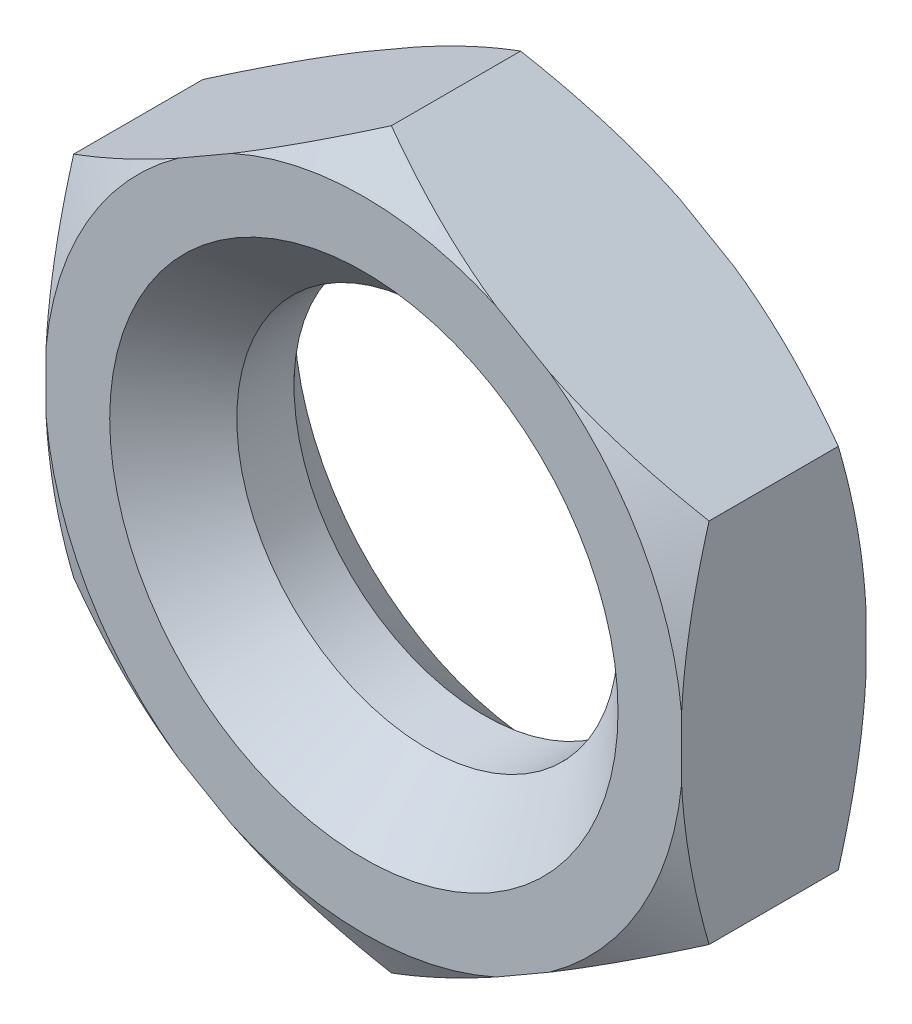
from build123d import *

# Parameters (mm, degrees)
BOSS_EXTRUDE1_DEPTH = 1.45
SKETCH6_R           = 3
CUT_EXTRUDE1_DEPTH  = 2.9
CHAMFER1_SIZE       = 1


with BuildPart() as part:
    # Sketch3 → Boss-Extrude1 (new, symmetric)
    with BuildSketch(Plane.XY):
        Polygon((0, 5.773502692), (-5, 2.886751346), (-5, -2.886751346), (0, -5.773502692), (5, -2.886751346), (5, 2.886751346), align=None)
    extrude(amount=BOSS_EXTRUDE1_DEPTH, both=True)

    # Sketch5 → Cut-Revolve1 (revolve, cut)
    with BuildSketch(Plane(origin=(0, 0, 0), x_dir=(0, 0, -1), z_dir=(1, 0, 0))):
        Polygon((-1.45, 5.773502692), (-1.45, 5.023502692), (-1.016987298, 5.773502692), align=None)
    cut_revolve1 = revolve(axis=Axis((0, 0, 5.457798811), (0, 0, -1)), mode=Mode.SUBTRACT)

    # Mirror1: Cut-Revolve1 across plane
    add(cut_revolve1.mirror(Plane.XY), mode=Mode.SUBTRACT)

    # Sketch6 → Cut-Extrude1 (cut)
    with BuildSketch(Plane.XY.offset(1.45)):
        Circle(SKETCH6_R)
    extrude(amount=-CUT_EXTRUDE1_DEPTH, mode=Mode.SUBTRACT)

    # Chamfer1
    chamfer1_edges = [part.edges().sort_by_distance(p)[0] for p in [
        (-3, 0, -1.45),
        (-3, 0, 1.45),
    ]]
    chamfer(chamfer1_edges, length=CHAMFER1_SIZE)


solid = part.part
